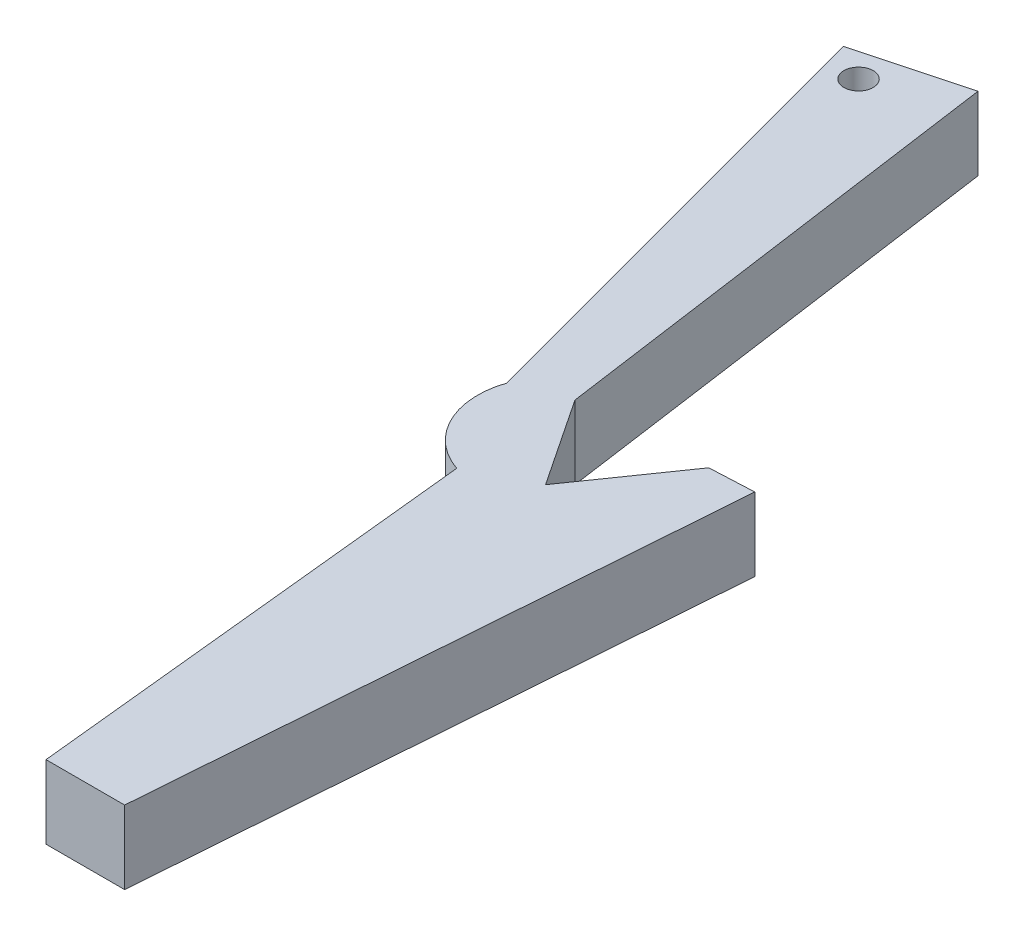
from build123d import *

# Parameters (mm, degrees)
BOSS_EXTRUDE1_DEPTH = 10
SKETCH3_R           = 2
CUT_EXTRUDE1_DEPTH  = 122.320118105


with BuildPart() as part:
    # Sketch2 → Boss-Extrude1 (new body)
    with BuildSketch(Plane(origin=(0, 0, 0), x_dir=(1, 0, 0), z_dir=(0, 1, 0))):
        with BuildLine():
            Line((37.515820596, 43.763027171), (23.026933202, 39.880741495))
            Line((23.026933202, 39.880741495), (39.850171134, -22.904437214))
            ThreePointArc((39.850171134, -22.904437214), (40.390315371, -31.01944777), (46.510434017, -36.375687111))
            Line((46.510434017, -36.375687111), (52.915573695, -98.830913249))
            Line((52.915573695, -98.830913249), (63.649275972, -98.830913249))
            Line((63.649275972, -98.830913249), (69.649275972, -18.830913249))
            Line((69.649275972, -18.830913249), (63.649275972, -19.115004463))
            Line((63.649275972, -19.115004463), (54.510434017, -32.248228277))
            Line((54.510434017, -32.248228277), (46.510434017, -20.236972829))
            Line((46.510434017, -20.236972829), (37.515820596, 43.763027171))
        make_face()
    extrude(amount=BOSS_EXTRUDE1_DEPTH)

    # Sketch3 → Cut-Extrude1 (cut, through all)
    with BuildSketch(Plane(origin=(0, 10, 0), x_dir=(1, 0, 0), z_dir=(0, 1, 0))):
        with Locations(Location((27.925912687, 37.05231437, 0), (0, 0, 270))):
            Circle(SKETCH3_R)
    extrude(amount=-CUT_EXTRUDE1_DEPTH, mode=Mode.SUBTRACT)


solid = part.part
